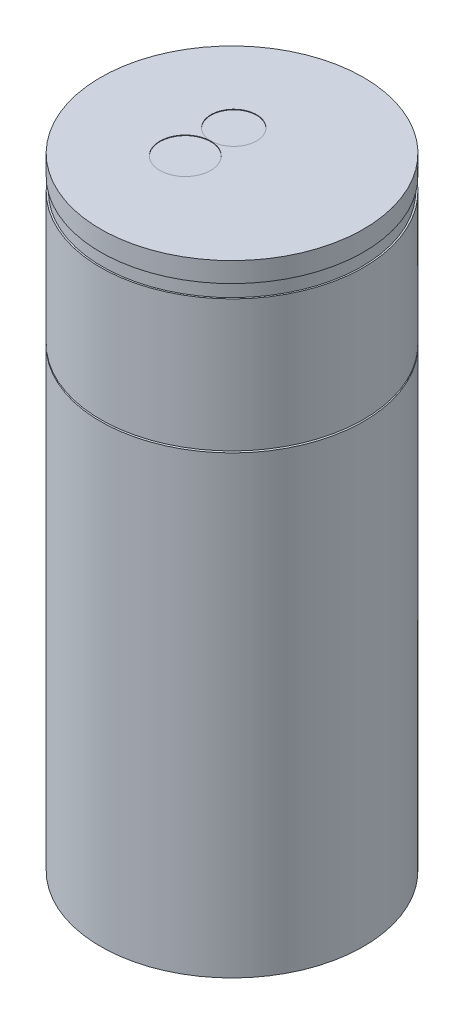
ISO-10303-21;
HEADER;
FILE_DESCRIPTION(('STEP AP214'),'2;1');
FILE_NAME('part.step','',(''),(''),'','','');
FILE_SCHEMA(('AUTOMOTIVE_DESIGN { 1 0 10303 214 1 1 1 1 }'));
ENDSEC;
DATA;
#1=APPLICATION_CONTEXT('core data for automotive mechanical design processes');
#2=APPLICATION_PROTOCOL_DEFINITION('international standard','automotive_design',2000,#1);
#3=PRODUCT_CONTEXT('',#1,'mechanical');
#4=PRODUCT('Part','Part','',(#3));
#5=PRODUCT_RELATED_PRODUCT_CATEGORY('part','',(#4));
#6=PRODUCT_DEFINITION_FORMATION('','',#4);
#7=PRODUCT_DEFINITION_CONTEXT('part definition',#1,'design');
#8=PRODUCT_DEFINITION('design','',#6,#7);
#9=PRODUCT_DEFINITION_SHAPE('','',#8);
#10=(LENGTH_UNIT() NAMED_UNIT(*) SI_UNIT(.MILLI.,.METRE.));
#11=(NAMED_UNIT(*) PLANE_ANGLE_UNIT() SI_UNIT($,.RADIAN.));
#12=(NAMED_UNIT(*) SI_UNIT($,.STERADIAN.) SOLID_ANGLE_UNIT());
#13=UNCERTAINTY_MEASURE_WITH_UNIT(LENGTH_MEASURE(1.E-05),#10,'distance_accuracy_value','');
#14=(GEOMETRIC_REPRESENTATION_CONTEXT(3) GLOBAL_UNCERTAINTY_ASSIGNED_CONTEXT((#13)) GLOBAL_UNIT_ASSIGNED_CONTEXT((#10,
#11,#12)) REPRESENTATION_CONTEXT('',''));
#15=CARTESIAN_POINT('',(0.,0.,0.));
#16=DIRECTION('',(0.,0.,1.));
#17=DIRECTION('',(1.,0.,0.));
#18=AXIS2_PLACEMENT_3D('',#15,#16,#17);
#19=CARTESIAN_POINT('',(0.,148.844,0.));
#20=DIRECTION('',(0.,-1.,0.));
#21=DIRECTION('',(0.,0.,-1.));
#22=AXIS2_PLACEMENT_3D('',#19,#20,#21);
#23=PLANE('',#22);
#24=CARTESIAN_POINT('',(-5.08,148.844,6.1214));
#25=DIRECTION('',(0.,1.,0.));
#26=DIRECTION('',(0.,0.,1.));
#27=AXIS2_PLACEMENT_3D('',#24,#25,#26);
#28=CIRCLE('',#27,6.096);
#29=CARTESIAN_POINT('',(-5.08,148.844,12.2174));
#30=VERTEX_POINT('',#29);
#31=EDGE_CURVE('E86',#30,#30,#28,.T.);
#32=ORIENTED_EDGE('',*,*,#31,.F.);
#33=EDGE_LOOP('',(#32));
#34=FACE_BOUND('',#33,.T.);
#35=CARTESIAN_POINT('',(-5.08,148.844,-5.4864));
#36=DIRECTION('',(0.,1.,0.));
#37=DIRECTION('',(0.,0.,1.));
#38=AXIS2_PLACEMENT_3D('',#35,#36,#37);
#39=CIRCLE('',#38,5.461);
#40=CARTESIAN_POINT('',(-5.08,148.844,-0.0254000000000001));
#41=VERTEX_POINT('',#40);
#42=EDGE_CURVE('E80',#41,#41,#39,.T.);
#43=ORIENTED_EDGE('',*,*,#42,.F.);
#44=EDGE_LOOP('',(#43));
#45=FACE_BOUND('',#44,.T.);
#46=CARTESIAN_POINT('',(0.,148.844,0.));
#47=DIRECTION('',(0.,-1.,0.));
#48=DIRECTION('',(0.,0.,-1.));
#49=AXIS2_PLACEMENT_3D('',#46,#47,#48);
#50=CIRCLE('',#49,31.496);
#51=CARTESIAN_POINT('',(0.,148.844,-31.496));
#52=VERTEX_POINT('',#51);
#53=EDGE_CURVE('E10',#52,#52,#50,.T.);
#54=ORIENTED_EDGE('',*,*,#53,.F.);
#55=EDGE_LOOP('',(#54));
#56=FACE_BOUND('',#55,.T.);
#57=ADVANCED_FACE('F36',(#34,#45,#56),#23,.F.);
#58=CARTESIAN_POINT('',(0.,-34.5931675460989,0.));
#59=DIRECTION('',(0.,-1.,0.));
#60=DIRECTION('',(0.,0.,-1.));
#61=AXIS2_PLACEMENT_3D('',#58,#59,#60);
#62=CYLINDRICAL_SURFACE('',#61,31.496);
#63=CARTESIAN_POINT('',(0.,144.0688,0.));
#64=DIRECTION('',(0.,-1.,0.));
#65=DIRECTION('',(0.,0.,-1.));
#66=AXIS2_PLACEMENT_3D('',#63,#64,#65);
#67=CIRCLE('',#66,31.496);
#68=CARTESIAN_POINT('',(0.,144.0688,-31.496));
#69=VERTEX_POINT('',#68);
#70=EDGE_CURVE('E43',#69,#69,#67,.T.);
#71=ORIENTED_EDGE('',*,*,#70,.F.);
#72=EDGE_LOOP('',(#71));
#73=FACE_BOUND('',#72,.T.);
#74=ORIENTED_EDGE('',*,*,#53,.T.);
#75=EDGE_LOOP('',(#74));
#76=FACE_BOUND('',#75,.T.);
#77=ADVANCED_FACE('F103',(#73,#76),#62,.T.);
#78=CARTESIAN_POINT('',(-31.496,144.0688,0.));
#79=DIRECTION('',(0.,1.,0.));
#80=DIRECTION('',(0.,0.,1.));
#81=AXIS2_PLACEMENT_3D('',#78,#79,#80);
#82=PLANE('',#81);
#83=CARTESIAN_POINT('',(0.,144.0688,0.));
#84=DIRECTION('',(0.,-1.,0.));
#85=DIRECTION('',(0.,0.,-1.));
#86=AXIS2_PLACEMENT_3D('',#83,#84,#85);
#87=CIRCLE('',#86,31.115);
#88=CARTESIAN_POINT('',(0.,144.0688,-31.115));
#89=VERTEX_POINT('',#88);
#90=EDGE_CURVE('E50',#89,#89,#87,.T.);
#91=ORIENTED_EDGE('',*,*,#90,.F.);
#92=EDGE_LOOP('',(#91));
#93=FACE_BOUND('',#92,.T.);
#94=ORIENTED_EDGE('',*,*,#70,.T.);
#95=EDGE_LOOP('',(#94));
#96=FACE_BOUND('',#95,.T.);
#97=ADVANCED_FACE('F149',(#93,#96),#82,.F.);
#98=CARTESIAN_POINT('',(0.,-34.5931675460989,0.));
#99=DIRECTION('',(0.,-1.,0.));
#100=DIRECTION('',(0.,0.,-1.));
#101=AXIS2_PLACEMENT_3D('',#98,#99,#100);
#102=CYLINDRICAL_SURFACE('',#101,31.115);
#103=CARTESIAN_POINT('',(0.,140.8938,0.));
#104=DIRECTION('',(0.,-1.,0.));
#105=DIRECTION('',(0.,0.,-1.));
#106=AXIS2_PLACEMENT_3D('',#103,#104,#105);
#107=CIRCLE('',#106,31.115);
#108=CARTESIAN_POINT('',(0.,140.8938,-31.115));
#109=VERTEX_POINT('',#108);
#110=EDGE_CURVE('E55',#109,#109,#107,.T.);
#111=ORIENTED_EDGE('',*,*,#110,.F.);
#112=EDGE_LOOP('',(#111));
#113=FACE_BOUND('',#112,.T.);
#114=ORIENTED_EDGE('',*,*,#90,.T.);
#115=EDGE_LOOP('',(#114));
#116=FACE_BOUND('',#115,.T.);
#117=ADVANCED_FACE('F145',(#113,#116),#102,.T.);
#118=CARTESIAN_POINT('',(-31.115,140.8938,0.));
#119=DIRECTION('',(0.,-1.,0.));
#120=DIRECTION('',(0.,0.,-1.));
#121=AXIS2_PLACEMENT_3D('',#118,#119,#120);
#122=PLANE('',#121);
#123=CARTESIAN_POINT('',(0.,140.8938,0.));
#124=DIRECTION('',(0.,-1.,0.));
#125=DIRECTION('',(0.,0.,-1.));
#126=AXIS2_PLACEMENT_3D('',#123,#124,#125);
#127=CIRCLE('',#126,31.496);
#128=CARTESIAN_POINT('',(0.,140.8938,-31.496));
#129=VERTEX_POINT('',#128);
#130=EDGE_CURVE('E60',#129,#129,#127,.T.);
#131=ORIENTED_EDGE('',*,*,#130,.F.);
#132=EDGE_LOOP('',(#131));
#133=FACE_BOUND('',#132,.T.);
#134=ORIENTED_EDGE('',*,*,#110,.T.);
#135=EDGE_LOOP('',(#134));
#136=FACE_BOUND('',#135,.T.);
#137=ADVANCED_FACE('F141',(#133,#136),#122,.F.);
#138=CARTESIAN_POINT('',(0.,-34.5931675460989,0.));
#139=DIRECTION('',(0.,-1.,0.));
#140=DIRECTION('',(0.,0.,-1.));
#141=AXIS2_PLACEMENT_3D('',#138,#139,#140);
#142=CYLINDRICAL_SURFACE('',#141,31.496);
#143=CARTESIAN_POINT('',(0.,109.347,0.));
#144=DIRECTION('',(0.,-1.,0.));
#145=DIRECTION('',(0.,0.,-1.));
#146=AXIS2_PLACEMENT_3D('',#143,#144,#145);
#147=CIRCLE('',#146,31.496);
#148=CARTESIAN_POINT('',(0.,109.347,-31.496));
#149=VERTEX_POINT('',#148);
#150=EDGE_CURVE('E64',#149,#149,#147,.T.);
#151=ORIENTED_EDGE('',*,*,#150,.F.);
#152=EDGE_LOOP('',(#151));
#153=FACE_BOUND('',#152,.T.);
#154=ORIENTED_EDGE('',*,*,#130,.T.);
#155=EDGE_LOOP('',(#154));
#156=FACE_BOUND('',#155,.T.);
#157=ADVANCED_FACE('F137',(#153,#156),#142,.T.);
#158=CARTESIAN_POINT('',(-31.496,109.347,0.));
#159=DIRECTION('',(0.,1.,0.));
#160=DIRECTION('',(0.,0.,1.));
#161=AXIS2_PLACEMENT_3D('',#158,#159,#160);
#162=PLANE('',#161);
#163=CARTESIAN_POINT('',(0.,109.347,0.));
#164=DIRECTION('',(0.,-1.,0.));
#165=DIRECTION('',(0.,0.,-1.));
#166=AXIS2_PLACEMENT_3D('',#163,#164,#165);
#167=CIRCLE('',#166,25.146);
#168=CARTESIAN_POINT('',(0.,109.347,-25.146));
#169=VERTEX_POINT('',#168);
#170=EDGE_CURVE('E67',#169,#169,#167,.T.);
#171=ORIENTED_EDGE('',*,*,#170,.F.);
#172=EDGE_LOOP('',(#171));
#173=FACE_BOUND('',#172,.T.);
#174=ORIENTED_EDGE('',*,*,#150,.T.);
#175=EDGE_LOOP('',(#174));
#176=FACE_BOUND('',#175,.T.);
#177=ADVANCED_FACE('F133',(#173,#176),#162,.F.);
#178=CARTESIAN_POINT('',(0.,-34.5931675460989,0.));
#179=DIRECTION('',(0.,-1.,0.));
#180=DIRECTION('',(0.,0.,-1.));
#181=AXIS2_PLACEMENT_3D('',#178,#179,#180);
#182=CYLINDRICAL_SURFACE('',#181,25.146);
#183=CARTESIAN_POINT('',(0.,108.9406,0.));
#184=DIRECTION('',(0.,-1.,0.));
#185=DIRECTION('',(0.,0.,-1.));
#186=AXIS2_PLACEMENT_3D('',#183,#184,#185);
#187=CIRCLE('',#186,25.146);
#188=CARTESIAN_POINT('',(0.,108.9406,-25.146));
#189=VERTEX_POINT('',#188);
#190=EDGE_CURVE('E70',#189,#189,#187,.T.);
#191=ORIENTED_EDGE('',*,*,#190,.F.);
#192=EDGE_LOOP('',(#191));
#193=FACE_BOUND('',#192,.T.);
#194=ORIENTED_EDGE('',*,*,#170,.T.);
#195=EDGE_LOOP('',(#194));
#196=FACE_BOUND('',#195,.T.);
#197=ADVANCED_FACE('F129',(#193,#196),#182,.T.);
#198=CARTESIAN_POINT('',(-25.146,108.9406,0.));
#199=DIRECTION('',(0.,-1.,0.));
#200=DIRECTION('',(0.,0.,-1.));
#201=AXIS2_PLACEMENT_3D('',#198,#199,#200);
#202=PLANE('',#201);
#203=CARTESIAN_POINT('',(0.,108.9406,0.));
#204=DIRECTION('',(0.,-1.,0.));
#205=DIRECTION('',(0.,0.,-1.));
#206=AXIS2_PLACEMENT_3D('',#203,#204,#205);
#207=CIRCLE('',#206,31.496);
#208=CARTESIAN_POINT('',(0.,108.9406,-31.496));
#209=VERTEX_POINT('',#208);
#210=EDGE_CURVE('E73',#209,#209,#207,.T.);
#211=ORIENTED_EDGE('',*,*,#210,.F.);
#212=EDGE_LOOP('',(#211));
#213=FACE_BOUND('',#212,.T.);
#214=ORIENTED_EDGE('',*,*,#190,.T.);
#215=EDGE_LOOP('',(#214));
#216=FACE_BOUND('',#215,.T.);
#217=ADVANCED_FACE('F125',(#213,#216),#202,.F.);
#218=CARTESIAN_POINT('',(0.,-34.5931675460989,0.));
#219=DIRECTION('',(0.,-1.,0.));
#220=DIRECTION('',(0.,0.,-1.));
#221=AXIS2_PLACEMENT_3D('',#218,#219,#220);
#222=CYLINDRICAL_SURFACE('',#221,31.496);
#223=CARTESIAN_POINT('',(0.,0.,0.));
#224=DIRECTION('',(0.,-1.,0.));
#225=DIRECTION('',(0.,0.,-1.));
#226=AXIS2_PLACEMENT_3D('',#223,#224,#225);
#227=CIRCLE('',#226,31.496);
#228=CARTESIAN_POINT('',(0.,0.,-31.496));
#229=VERTEX_POINT('',#228);
#230=EDGE_CURVE('E76',#229,#229,#227,.T.);
#231=ORIENTED_EDGE('',*,*,#230,.F.);
#232=EDGE_LOOP('',(#231));
#233=FACE_BOUND('',#232,.T.);
#234=ORIENTED_EDGE('',*,*,#210,.T.);
#235=EDGE_LOOP('',(#234));
#236=FACE_BOUND('',#235,.T.);
#237=ADVANCED_FACE('F118',(#233,#236),#222,.T.);
#238=CARTESIAN_POINT('',(-31.496,0.,0.));
#239=DIRECTION('',(0.,1.,0.));
#240=DIRECTION('',(0.,0.,1.));
#241=AXIS2_PLACEMENT_3D('',#238,#239,#240);
#242=PLANE('',#241);
#243=ORIENTED_EDGE('',*,*,#230,.T.);
#244=EDGE_LOOP('',(#243));
#245=FACE_BOUND('',#244,.T.);
#246=ADVANCED_FACE('F109',(#245),#242,.F.);
#247=CARTESIAN_POINT('',(-5.08,148.717,-5.4864));
#248=DIRECTION('',(0.,1.,0.));
#249=DIRECTION('',(0.,0.,1.));
#250=AXIS2_PLACEMENT_3D('',#247,#248,#249);
#251=CYLINDRICAL_SURFACE('',#250,5.461);
#252=CARTESIAN_POINT('',(-5.08,148.717,-5.4864));
#253=DIRECTION('',(0.,1.,0.));
#254=DIRECTION('',(0.,0.,1.));
#255=AXIS2_PLACEMENT_3D('',#252,#253,#254);
#256=CIRCLE('',#255,5.461);
#257=CARTESIAN_POINT('',(-5.08,148.717,-0.0254000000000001));
#258=VERTEX_POINT('',#257);
#259=EDGE_CURVE('E79',#258,#258,#256,.T.);
#260=ORIENTED_EDGE('',*,*,#259,.F.);
#261=EDGE_LOOP('',(#260));
#262=FACE_BOUND('',#261,.T.);
#263=ORIENTED_EDGE('',*,*,#42,.T.);
#264=EDGE_LOOP('',(#263));
#265=FACE_BOUND('',#264,.T.);
#266=ADVANCED_FACE('F107',(#262,#265),#251,.F.);
#267=CARTESIAN_POINT('',(-5.08,148.717,-5.4864));
#268=DIRECTION('',(0.,1.,0.));
#269=DIRECTION('',(0.,0.,1.));
#270=AXIS2_PLACEMENT_3D('',#267,#268,#269);
#271=PLANE('',#270);
#272=ORIENTED_EDGE('',*,*,#259,.T.);
#273=EDGE_LOOP('',(#272));
#274=FACE_BOUND('',#273,.T.);
#275=ADVANCED_FACE('F97',(#274),#271,.T.);
#276=CARTESIAN_POINT('',(-5.08,148.717,6.1214));
#277=DIRECTION('',(0.,1.,0.));
#278=DIRECTION('',(0.,0.,1.));
#279=AXIS2_PLACEMENT_3D('',#276,#277,#278);
#280=CYLINDRICAL_SURFACE('',#279,6.096);
#281=CARTESIAN_POINT('',(-5.08,148.717,6.1214));
#282=DIRECTION('',(0.,1.,0.));
#283=DIRECTION('',(0.,0.,1.));
#284=AXIS2_PLACEMENT_3D('',#281,#282,#283);
#285=CIRCLE('',#284,6.096);
#286=CARTESIAN_POINT('',(-5.08,148.717,12.2174));
#287=VERTEX_POINT('',#286);
#288=EDGE_CURVE('E83',#287,#287,#285,.T.);
#289=ORIENTED_EDGE('',*,*,#288,.F.);
#290=EDGE_LOOP('',(#289));
#291=FACE_BOUND('',#290,.T.);
#292=ORIENTED_EDGE('',*,*,#31,.T.);
#293=EDGE_LOOP('',(#292));
#294=FACE_BOUND('',#293,.T.);
#295=ADVANCED_FACE('F94',(#291,#294),#280,.F.);
#296=CARTESIAN_POINT('',(-5.08,148.717,6.1214));
#297=DIRECTION('',(0.,1.,0.));
#298=DIRECTION('',(0.,0.,1.));
#299=AXIS2_PLACEMENT_3D('',#296,#297,#298);
#300=PLANE('',#299);
#301=ORIENTED_EDGE('',*,*,#288,.T.);
#302=EDGE_LOOP('',(#301));
#303=FACE_BOUND('',#302,.T.);
#304=ADVANCED_FACE('F92',(#303),#300,.T.);
#305=CLOSED_SHELL('',(#57,#77,#97,#117,#137,#157,#177,#197,#217,#237,#246,#266,#275,#295,#304));
#306=MANIFOLD_SOLID_BREP('B2',#305);
#307=ADVANCED_BREP_SHAPE_REPRESENTATION('',(#18,#306),#14);
#308=SHAPE_DEFINITION_REPRESENTATION(#9,#307);
ENDSEC;
END-ISO-10303-21;
